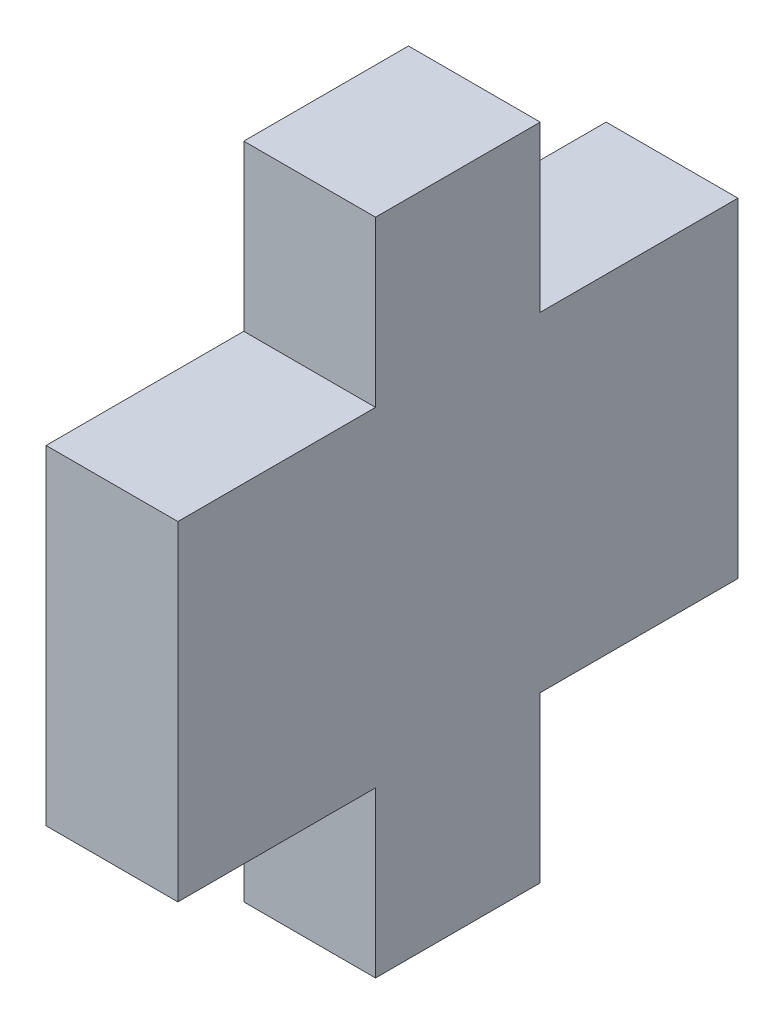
from build123d import *

# Parameters (mm, degrees)
EXTRUDE1_DEPTH = 10


with BuildPart() as part:
    # Sketch1 → Extrude1 (new, symmetric)
    with BuildSketch(Plane(origin=(0, 0, 0), x_dir=(0, 0, -1), z_dir=(1, 0, 0))):
        Polygon((0, -25), (0, 25), (30, 25), (30, 50), (55, 50), (55, 25), (85, 25), (85, -25), (55, -25), (55, -50), (30, -50), (30, -25), align=None)
    extrude(amount=EXTRUDE1_DEPTH, both=True)


solid = part.part
